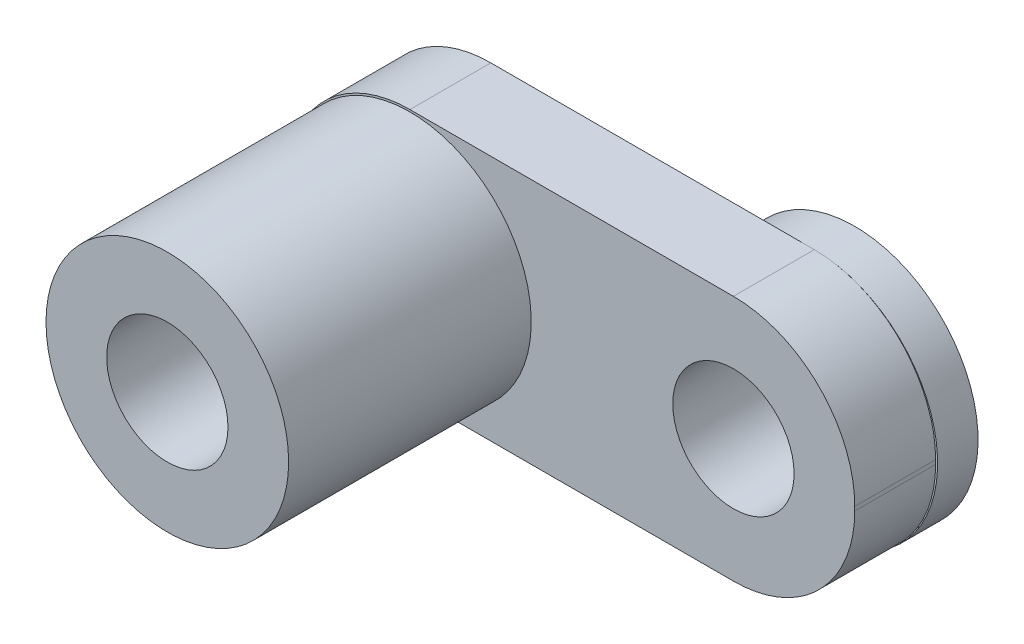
ISO-10303-21;
HEADER;
FILE_DESCRIPTION(('STEP AP214'),'2;1');
FILE_NAME('part.step','',(''),(''),'','','');
FILE_SCHEMA(('AUTOMOTIVE_DESIGN { 1 0 10303 214 1 1 1 1 }'));
ENDSEC;
DATA;
#1=APPLICATION_CONTEXT('core data for automotive mechanical design processes');
#2=APPLICATION_PROTOCOL_DEFINITION('international standard','automotive_design',2000,#1);
#3=PRODUCT_CONTEXT('',#1,'mechanical');
#4=PRODUCT('Part','Part','',(#3));
#5=PRODUCT_RELATED_PRODUCT_CATEGORY('part','',(#4));
#6=PRODUCT_DEFINITION_FORMATION('','',#4);
#7=PRODUCT_DEFINITION_CONTEXT('part definition',#1,'design');
#8=PRODUCT_DEFINITION('design','',#6,#7);
#9=PRODUCT_DEFINITION_SHAPE('','',#8);
#10=(LENGTH_UNIT() NAMED_UNIT(*) SI_UNIT(.MILLI.,.METRE.));
#11=(NAMED_UNIT(*) PLANE_ANGLE_UNIT() SI_UNIT($,.RADIAN.));
#12=(NAMED_UNIT(*) SI_UNIT($,.STERADIAN.) SOLID_ANGLE_UNIT());
#13=UNCERTAINTY_MEASURE_WITH_UNIT(LENGTH_MEASURE(1.E-05),#10,'distance_accuracy_value','');
#14=(GEOMETRIC_REPRESENTATION_CONTEXT(3) GLOBAL_UNCERTAINTY_ASSIGNED_CONTEXT((#13)) GLOBAL_UNIT_ASSIGNED_CONTEXT((#10,
#11,#12)) REPRESENTATION_CONTEXT('',''));
#15=CARTESIAN_POINT('',(0.,0.,0.));
#16=DIRECTION('',(0.,0.,1.));
#17=DIRECTION('',(1.,0.,0.));
#18=AXIS2_PLACEMENT_3D('',#15,#16,#17);
#19=CARTESIAN_POINT('',(3.,3.1,0.));
#20=DIRECTION('',(0.,0.,-1.));
#21=DIRECTION('',(-1.,0.,0.));
#22=AXIS2_PLACEMENT_3D('',#19,#20,#21);
#23=PLANE('',#22);
#24=CARTESIAN_POINT('',(3.,3.05,0.));
#25=DIRECTION('',(0.,0.,-1.));
#26=DIRECTION('',(-1.,0.,0.));
#27=AXIS2_PLACEMENT_3D('',#24,#25,#26);
#28=CIRCLE('',#27,1.5);
#29=CARTESIAN_POINT('',(1.5,3.05,0.));
#30=VERTEX_POINT('',#29);
#31=EDGE_CURVE('E113',#30,#30,#28,.T.);
#32=ORIENTED_EDGE('',*,*,#31,.F.);
#33=EDGE_LOOP('',(#32));
#34=FACE_BOUND('',#33,.T.);
#35=DIRECTION('',(-1.,0.,0.));
#36=VECTOR('',#35,1.);
#37=CARTESIAN_POINT('',(3.00000000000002,6.1,0.));
#38=LINE('',#37,#36);
#39=CARTESIAN_POINT('',(11.,6.1,0.));
#40=VERTEX_POINT('',#39);
#41=CARTESIAN_POINT('',(3.00000000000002,6.1,0.));
#42=VERTEX_POINT('',#41);
#43=EDGE_CURVE('E122',#40,#42,#38,.T.);
#44=ORIENTED_EDGE('',*,*,#43,.F.);
#45=CARTESIAN_POINT('',(11.,3.05,0.));
#46=DIRECTION('',(0.,0.,-1.));
#47=DIRECTION('',(-1.,0.,0.));
#48=AXIS2_PLACEMENT_3D('',#45,#46,#47);
#49=CIRCLE('',#48,3.05);
#50=CARTESIAN_POINT('',(11.,0.,0.));
#51=VERTEX_POINT('',#50);
#52=EDGE_CURVE('E11',#40,#51,#49,.F.);
#53=ORIENTED_EDGE('',*,*,#52,.T.);
#54=DIRECTION('',(1.,0.,0.));
#55=VECTOR('',#54,1.);
#56=CARTESIAN_POINT('',(3.00000000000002,0.,0.));
#57=LINE('',#56,#55);
#58=CARTESIAN_POINT('',(3.00000000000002,0.,0.));
#59=VERTEX_POINT('',#58);
#60=EDGE_CURVE('E183',#59,#51,#57,.T.);
#61=ORIENTED_EDGE('',*,*,#60,.F.);
#62=CARTESIAN_POINT('',(3.,3.,0.));
#63=DIRECTION('',(0.,0.,1.));
#64=DIRECTION('',(-1.,0.,0.));
#65=AXIS2_PLACEMENT_3D('',#62,#63,#64);
#66=CIRCLE('',#65,3.);
#67=CARTESIAN_POINT('',(0.,3.00000000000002,0.));
#68=VERTEX_POINT('',#67);
#69=EDGE_CURVE('E175',#68,#59,#66,.T.);
#70=ORIENTED_EDGE('',*,*,#69,.F.);
#71=DIRECTION('',(0.,-1.,0.));
#72=VECTOR('',#71,1.);
#73=CARTESIAN_POINT('',(0.,3.00000000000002,0.));
#74=LINE('',#73,#72);
#75=CARTESIAN_POINT('',(0.,3.09999999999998,0.));
#76=VERTEX_POINT('',#75);
#77=EDGE_CURVE('E169',#76,#68,#74,.T.);
#78=ORIENTED_EDGE('',*,*,#77,.F.);
#79=CARTESIAN_POINT('',(3.,3.1,0.));
#80=DIRECTION('',(0.,0.,1.));
#81=DIRECTION('',(-1.,0.,0.));
#82=AXIS2_PLACEMENT_3D('',#79,#80,#81);
#83=CIRCLE('',#82,3.);
#84=EDGE_CURVE('E132',#42,#76,#83,.T.);
#85=ORIENTED_EDGE('',*,*,#84,.F.);
#86=EDGE_LOOP('',(#44,#53,#61,#70,#78,#85));
#87=FACE_BOUND('',#86,.T.);
#88=ADVANCED_FACE('F31',(#34,#87),#23,.T.);
#89=CARTESIAN_POINT('',(3.,3.1,2.));
#90=DIRECTION('',(0.,0.,-1.));
#91=DIRECTION('',(-1.,0.,0.));
#92=AXIS2_PLACEMENT_3D('',#89,#90,#91);
#93=PLANE('',#92);
#94=CARTESIAN_POINT('',(11.,3.05,2.));
#95=DIRECTION('',(0.,0.,-1.));
#96=DIRECTION('',(-1.,0.,0.));
#97=AXIS2_PLACEMENT_3D('',#94,#95,#96);
#98=CIRCLE('',#97,1.5);
#99=CARTESIAN_POINT('',(9.5,3.05,2.));
#100=VERTEX_POINT('',#99);
#101=EDGE_CURVE('E213',#100,#100,#98,.T.);
#102=ORIENTED_EDGE('',*,*,#101,.T.);
#103=EDGE_LOOP('',(#102));
#104=FACE_BOUND('',#103,.T.);
#105=DIRECTION('',(0.,-1.,0.));
#106=VECTOR('',#105,1.);
#107=CARTESIAN_POINT('',(0.,3.00000000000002,2.));
#108=LINE('',#107,#106);
#109=CARTESIAN_POINT('',(0.,3.09999999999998,2.));
#110=VERTEX_POINT('',#109);
#111=CARTESIAN_POINT('',(0.,3.05,2.));
#112=VERTEX_POINT('',#111);
#113=EDGE_CURVE('E139',#110,#112,#108,.T.);
#114=ORIENTED_EDGE('',*,*,#113,.T.);
#115=CARTESIAN_POINT('',(3.,3.05,2.));
#116=DIRECTION('',(0.,0.,1.));
#117=DIRECTION('',(1.,0.,0.));
#118=AXIS2_PLACEMENT_3D('',#115,#116,#117);
#119=CIRCLE('',#118,3.);
#120=EDGE_CURVE('E178',#112,#112,#119,.T.);
#121=ORIENTED_EDGE('',*,*,#120,.F.);
#122=CARTESIAN_POINT('',(0.,3.00000000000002,2.));
#123=VERTEX_POINT('',#122);
#124=EDGE_CURVE('E135',#112,#123,#108,.T.);
#125=ORIENTED_EDGE('',*,*,#124,.T.);
#126=CARTESIAN_POINT('',(3.,3.,2.));
#127=DIRECTION('',(0.,0.,1.));
#128=DIRECTION('',(-1.,0.,0.));
#129=AXIS2_PLACEMENT_3D('',#126,#127,#128);
#130=CIRCLE('',#129,3.);
#131=CARTESIAN_POINT('',(3.00000000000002,0.,2.));
#132=VERTEX_POINT('',#131);
#133=EDGE_CURVE('E141',#123,#132,#130,.T.);
#134=ORIENTED_EDGE('',*,*,#133,.T.);
#135=DIRECTION('',(1.,0.,0.));
#136=VECTOR('',#135,1.);
#137=CARTESIAN_POINT('',(3.00000000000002,0.,2.));
#138=LINE('',#137,#136);
#139=CARTESIAN_POINT('',(11.,0.,2.));
#140=VERTEX_POINT('',#139);
#141=EDGE_CURVE('E143',#132,#140,#138,.T.);
#142=ORIENTED_EDGE('',*,*,#141,.T.);
#143=CARTESIAN_POINT('',(11.,3.,2.));
#144=DIRECTION('',(0.,0.,1.));
#145=DIRECTION('',(1.,0.,0.));
#146=AXIS2_PLACEMENT_3D('',#143,#144,#145);
#147=CIRCLE('',#146,3.);
#148=CARTESIAN_POINT('',(14.,3.00000000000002,2.));
#149=VERTEX_POINT('',#148);
#150=EDGE_CURVE('E145',#140,#149,#147,.T.);
#151=ORIENTED_EDGE('',*,*,#150,.T.);
#152=DIRECTION('',(0.,1.,0.));
#153=VECTOR('',#152,1.);
#154=CARTESIAN_POINT('',(14.,3.00000000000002,2.));
#155=LINE('',#154,#153);
#156=CARTESIAN_POINT('',(14.,3.09999999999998,2.));
#157=VERTEX_POINT('',#156);
#158=EDGE_CURVE('E147',#149,#157,#155,.T.);
#159=ORIENTED_EDGE('',*,*,#158,.T.);
#160=CARTESIAN_POINT('',(11.,3.1,2.));
#161=DIRECTION('',(0.,0.,1.));
#162=DIRECTION('',(-1.,0.,0.));
#163=AXIS2_PLACEMENT_3D('',#160,#161,#162);
#164=CIRCLE('',#163,3.);
#165=CARTESIAN_POINT('',(11.,6.1,2.));
#166=VERTEX_POINT('',#165);
#167=EDGE_CURVE('E51',#157,#166,#164,.T.);
#168=ORIENTED_EDGE('',*,*,#167,.T.);
#169=DIRECTION('',(-1.,0.,0.));
#170=VECTOR('',#169,1.);
#171=CARTESIAN_POINT('',(3.00000000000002,6.1,2.));
#172=LINE('',#171,#170);
#173=CARTESIAN_POINT('',(3.00000000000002,6.1,2.));
#174=VERTEX_POINT('',#173);
#175=EDGE_CURVE('E46',#166,#174,#172,.T.);
#176=ORIENTED_EDGE('',*,*,#175,.T.);
#177=CARTESIAN_POINT('',(3.,3.1,2.));
#178=DIRECTION('',(0.,0.,1.));
#179=DIRECTION('',(-1.,0.,0.));
#180=AXIS2_PLACEMENT_3D('',#177,#178,#179);
#181=CIRCLE('',#180,3.);
#182=EDGE_CURVE('E133',#174,#110,#181,.T.);
#183=ORIENTED_EDGE('',*,*,#182,.T.);
#184=EDGE_LOOP('',(#114,#121,#125,#134,#142,#151,#159,#168,#176,#183));
#185=FACE_BOUND('',#184,.T.);
#186=ADVANCED_FACE('F203',(#104,#185),#93,.F.);
#187=CARTESIAN_POINT('',(3.,3.1,2.));
#188=DIRECTION('',(0.,0.,-1.));
#189=DIRECTION('',(-1.,0.,0.));
#190=AXIS2_PLACEMENT_3D('',#187,#188,#189);
#191=CYLINDRICAL_SURFACE('',#190,3.);
#192=ORIENTED_EDGE('',*,*,#84,.T.);
#193=DIRECTION('',(0.,0.,-1.));
#194=VECTOR('',#193,1.);
#195=CARTESIAN_POINT('',(0.,3.09999999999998,2.));
#196=LINE('',#195,#194);
#197=EDGE_CURVE('E39',#110,#76,#196,.T.);
#198=ORIENTED_EDGE('',*,*,#197,.F.);
#199=ORIENTED_EDGE('',*,*,#182,.F.);
#200=DIRECTION('',(0.,0.,-1.));
#201=VECTOR('',#200,1.);
#202=CARTESIAN_POINT('',(3.00000000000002,6.1,2.));
#203=LINE('',#202,#201);
#204=EDGE_CURVE('E128',#174,#42,#203,.T.);
#205=ORIENTED_EDGE('',*,*,#204,.T.);
#206=EDGE_LOOP('',(#192,#198,#199,#205));
#207=FACE_BOUND('',#206,.T.);
#208=ADVANCED_FACE('F33',(#207),#191,.T.);
#209=CARTESIAN_POINT('',(0.,3.00000000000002,2.));
#210=DIRECTION('',(1.,0.,0.));
#211=DIRECTION('',(0.,0.,-1.));
#212=AXIS2_PLACEMENT_3D('',#209,#210,#211);
#213=PLANE('',#212);
#214=ORIENTED_EDGE('',*,*,#77,.T.);
#215=DIRECTION('',(0.,0.,-1.));
#216=VECTOR('',#215,1.);
#217=CARTESIAN_POINT('',(0.,3.00000000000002,2.));
#218=LINE('',#217,#216);
#219=EDGE_CURVE('E162',#123,#68,#218,.T.);
#220=ORIENTED_EDGE('',*,*,#219,.F.);
#221=ORIENTED_EDGE('',*,*,#124,.F.);
#222=ORIENTED_EDGE('',*,*,#113,.F.);
#223=ORIENTED_EDGE('',*,*,#197,.T.);
#224=EDGE_LOOP('',(#214,#220,#221,#222,#223));
#225=FACE_BOUND('',#224,.T.);
#226=ADVANCED_FACE('F167',(#225),#213,.F.);
#227=CARTESIAN_POINT('',(3.,3.,2.));
#228=DIRECTION('',(0.,0.,-1.));
#229=DIRECTION('',(-1.,0.,0.));
#230=AXIS2_PLACEMENT_3D('',#227,#228,#229);
#231=CYLINDRICAL_SURFACE('',#230,3.);
#232=ORIENTED_EDGE('',*,*,#69,.T.);
#233=DIRECTION('',(0.,0.,-1.));
#234=VECTOR('',#233,1.);
#235=CARTESIAN_POINT('',(3.00000000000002,0.,2.));
#236=LINE('',#235,#234);
#237=EDGE_CURVE('E159',#132,#59,#236,.T.);
#238=ORIENTED_EDGE('',*,*,#237,.F.);
#239=ORIENTED_EDGE('',*,*,#133,.F.);
#240=ORIENTED_EDGE('',*,*,#219,.T.);
#241=EDGE_LOOP('',(#232,#238,#239,#240));
#242=FACE_BOUND('',#241,.T.);
#243=ADVANCED_FACE('F199',(#242),#231,.T.);
#244=CARTESIAN_POINT('',(3.00000000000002,0.,2.));
#245=DIRECTION('',(0.,1.,0.));
#246=DIRECTION('',(0.,0.,1.));
#247=AXIS2_PLACEMENT_3D('',#244,#245,#246);
#248=PLANE('',#247);
#249=ORIENTED_EDGE('',*,*,#60,.T.);
#250=DIRECTION('',(0.,0.,-1.));
#251=VECTOR('',#250,1.);
#252=CARTESIAN_POINT('',(11.,0.,2.));
#253=LINE('',#252,#251);
#254=EDGE_CURVE('E156',#140,#51,#253,.T.);
#255=ORIENTED_EDGE('',*,*,#254,.F.);
#256=ORIENTED_EDGE('',*,*,#141,.F.);
#257=ORIENTED_EDGE('',*,*,#237,.T.);
#258=EDGE_LOOP('',(#249,#255,#256,#257));
#259=FACE_BOUND('',#258,.T.);
#260=ADVANCED_FACE('F195',(#259),#248,.F.);
#261=CARTESIAN_POINT('',(11.,3.,2.));
#262=DIRECTION('',(0.,0.,-1.));
#263=DIRECTION('',(-1.,0.,0.));
#264=AXIS2_PLACEMENT_3D('',#261,#262,#263);
#265=CYLINDRICAL_SURFACE('',#264,3.);
#266=CARTESIAN_POINT('',(11.,3.,0.));
#267=DIRECTION('',(0.,0.,1.));
#268=DIRECTION('',(1.,0.,0.));
#269=AXIS2_PLACEMENT_3D('',#266,#267,#268);
#270=CIRCLE('',#269,3.);
#271=CARTESIAN_POINT('',(14.,3.00000000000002,0.));
#272=VERTEX_POINT('',#271);
#273=EDGE_CURVE('E111',#51,#272,#270,.T.);
#274=ORIENTED_EDGE('',*,*,#273,.T.);
#275=DIRECTION('',(0.,0.,-1.));
#276=VECTOR('',#275,1.);
#277=CARTESIAN_POINT('',(14.,3.00000000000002,2.));
#278=LINE('',#277,#276);
#279=EDGE_CURVE('E153',#149,#272,#278,.T.);
#280=ORIENTED_EDGE('',*,*,#279,.F.);
#281=ORIENTED_EDGE('',*,*,#150,.F.);
#282=ORIENTED_EDGE('',*,*,#254,.T.);
#283=EDGE_LOOP('',(#274,#280,#281,#282));
#284=FACE_BOUND('',#283,.T.);
#285=ADVANCED_FACE('F190',(#284),#265,.T.);
#286=CARTESIAN_POINT('',(14.,3.00000000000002,2.));
#287=DIRECTION('',(-1.,0.,0.));
#288=DIRECTION('',(0.,0.,1.));
#289=AXIS2_PLACEMENT_3D('',#286,#287,#288);
#290=PLANE('',#289);
#291=DIRECTION('',(0.,1.,0.));
#292=VECTOR('',#291,1.);
#293=CARTESIAN_POINT('',(14.,3.00000000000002,0.));
#294=LINE('',#293,#292);
#295=CARTESIAN_POINT('',(14.,3.09999999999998,0.));
#296=VERTEX_POINT('',#295);
#297=EDGE_CURVE('E123',#272,#296,#294,.T.);
#298=ORIENTED_EDGE('',*,*,#297,.T.);
#299=DIRECTION('',(0.,0.,-1.));
#300=VECTOR('',#299,1.);
#301=CARTESIAN_POINT('',(14.,3.09999999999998,2.));
#302=LINE('',#301,#300);
#303=EDGE_CURVE('E121',#157,#296,#302,.T.);
#304=ORIENTED_EDGE('',*,*,#303,.F.);
#305=ORIENTED_EDGE('',*,*,#158,.F.);
#306=ORIENTED_EDGE('',*,*,#279,.T.);
#307=EDGE_LOOP('',(#298,#304,#305,#306));
#308=FACE_BOUND('',#307,.T.);
#309=ADVANCED_FACE('F186',(#308),#290,.F.);
#310=CARTESIAN_POINT('',(11.,3.1,2.));
#311=DIRECTION('',(0.,0.,-1.));
#312=DIRECTION('',(-1.,0.,0.));
#313=AXIS2_PLACEMENT_3D('',#310,#311,#312);
#314=CYLINDRICAL_SURFACE('',#313,3.);
#315=CARTESIAN_POINT('',(11.,3.1,0.));
#316=DIRECTION('',(0.,0.,1.));
#317=DIRECTION('',(-1.,0.,0.));
#318=AXIS2_PLACEMENT_3D('',#315,#316,#317);
#319=CIRCLE('',#318,3.);
#320=EDGE_CURVE('E108',#296,#40,#319,.T.);
#321=ORIENTED_EDGE('',*,*,#320,.T.);
#322=DIRECTION('',(0.,0.,-1.));
#323=VECTOR('',#322,1.);
#324=CARTESIAN_POINT('',(11.,6.1,2.));
#325=LINE('',#324,#323);
#326=EDGE_CURVE('E119',#166,#40,#325,.T.);
#327=ORIENTED_EDGE('',*,*,#326,.F.);
#328=ORIENTED_EDGE('',*,*,#167,.F.);
#329=ORIENTED_EDGE('',*,*,#303,.T.);
#330=EDGE_LOOP('',(#321,#327,#328,#329));
#331=FACE_BOUND('',#330,.T.);
#332=ADVANCED_FACE('F118',(#331),#314,.T.);
#333=CARTESIAN_POINT('',(3.00000000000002,6.1,2.));
#334=DIRECTION('',(0.,-1.,0.));
#335=DIRECTION('',(0.,0.,-1.));
#336=AXIS2_PLACEMENT_3D('',#333,#334,#335);
#337=PLANE('',#336);
#338=ORIENTED_EDGE('',*,*,#43,.T.);
#339=ORIENTED_EDGE('',*,*,#204,.F.);
#340=ORIENTED_EDGE('',*,*,#175,.F.);
#341=ORIENTED_EDGE('',*,*,#326,.T.);
#342=EDGE_LOOP('',(#338,#339,#340,#341));
#343=FACE_BOUND('',#342,.T.);
#344=ADVANCED_FACE('F126',(#343),#337,.F.);
#345=CARTESIAN_POINT('',(3.,3.05,8.));
#346=DIRECTION('',(0.,0.,-1.));
#347=DIRECTION('',(-1.,0.,0.));
#348=AXIS2_PLACEMENT_3D('',#345,#346,#347);
#349=CYLINDRICAL_SURFACE('',#348,3.);
#350=CARTESIAN_POINT('',(3.,3.05,8.));
#351=DIRECTION('',(0.,0.,1.));
#352=DIRECTION('',(1.,0.,0.));
#353=AXIS2_PLACEMENT_3D('',#350,#351,#352);
#354=CIRCLE('',#353,3.);
#355=CARTESIAN_POINT('',(6.,3.05,8.));
#356=VERTEX_POINT('',#355);
#357=EDGE_CURVE('E173',#356,#356,#354,.T.);
#358=ORIENTED_EDGE('',*,*,#357,.F.);
#359=EDGE_LOOP('',(#358));
#360=FACE_BOUND('',#359,.T.);
#361=ORIENTED_EDGE('',*,*,#120,.T.);
#362=EDGE_LOOP('',(#361));
#363=FACE_BOUND('',#362,.T.);
#364=ADVANCED_FACE('F243',(#360,#363),#349,.T.);
#365=CARTESIAN_POINT('',(3.,3.05,8.));
#366=DIRECTION('',(0.,0.,1.));
#367=DIRECTION('',(1.,0.,0.));
#368=AXIS2_PLACEMENT_3D('',#365,#366,#367);
#369=PLANE('',#368);
#370=CARTESIAN_POINT('',(3.,3.05,8.));
#371=DIRECTION('',(0.,0.,1.));
#372=DIRECTION('',(1.,0.,0.));
#373=AXIS2_PLACEMENT_3D('',#370,#371,#372);
#374=CIRCLE('',#373,1.5);
#375=CARTESIAN_POINT('',(4.5,3.05,8.));
#376=VERTEX_POINT('',#375);
#377=EDGE_CURVE('E210',#376,#376,#374,.T.);
#378=ORIENTED_EDGE('',*,*,#377,.F.);
#379=EDGE_LOOP('',(#378));
#380=FACE_BOUND('',#379,.T.);
#381=ORIENTED_EDGE('',*,*,#357,.T.);
#382=EDGE_LOOP('',(#381));
#383=FACE_BOUND('',#382,.T.);
#384=ADVANCED_FACE('F264',(#380,#383),#369,.T.);
#385=CARTESIAN_POINT('',(11.,3.05,0.));
#386=DIRECTION('',(0.,0.,-1.));
#387=DIRECTION('',(-1.,0.,0.));
#388=AXIS2_PLACEMENT_3D('',#385,#386,#387);
#389=PLANE('',#388);
#390=ORIENTED_EDGE('',*,*,#297,.F.);
#391=ORIENTED_EDGE('',*,*,#273,.F.);
#392=CARTESIAN_POINT('',(11.,3.05,0.));
#393=DIRECTION('',(0.,0.,-1.));
#394=DIRECTION('',(-1.,0.,0.));
#395=AXIS2_PLACEMENT_3D('',#392,#393,#394);
#396=CIRCLE('',#395,3.05);
#397=EDGE_CURVE('E99',#40,#51,#396,.T.);
#398=ORIENTED_EDGE('',*,*,#397,.F.);
#399=ORIENTED_EDGE('',*,*,#320,.F.);
#400=EDGE_LOOP('',(#390,#391,#398,#399));
#401=FACE_BOUND('',#400,.T.);
#402=ADVANCED_FACE('F107',(#401),#389,.F.);
#403=CARTESIAN_POINT('',(11.,3.05,-1.));
#404=DIRECTION('',(0.,0.,1.));
#405=DIRECTION('',(1.,0.,0.));
#406=AXIS2_PLACEMENT_3D('',#403,#404,#405);
#407=CYLINDRICAL_SURFACE('',#406,3.05);
#408=CARTESIAN_POINT('',(11.,3.05,-1.));
#409=DIRECTION('',(0.,0.,-1.));
#410=DIRECTION('',(-1.,0.,0.));
#411=AXIS2_PLACEMENT_3D('',#408,#409,#410);
#412=CIRCLE('',#411,3.05);
#413=CARTESIAN_POINT('',(7.95,3.05,-1.));
#414=VERTEX_POINT('',#413);
#415=EDGE_CURVE('E112',#414,#414,#412,.T.);
#416=ORIENTED_EDGE('',*,*,#415,.F.);
#417=EDGE_LOOP('',(#416));
#418=FACE_BOUND('',#417,.T.);
#419=ORIENTED_EDGE('',*,*,#397,.T.);
#420=ORIENTED_EDGE('',*,*,#52,.F.);
#421=EDGE_LOOP('',(#419,#420));
#422=FACE_BOUND('',#421,.T.);
#423=ADVANCED_FACE('F98',(#418,#422),#407,.T.);
#424=CARTESIAN_POINT('',(11.,3.05,-1.));
#425=DIRECTION('',(0.,0.,-1.));
#426=DIRECTION('',(-1.,0.,0.));
#427=AXIS2_PLACEMENT_3D('',#424,#425,#426);
#428=PLANE('',#427);
#429=CARTESIAN_POINT('',(11.,3.05,-1.));
#430=DIRECTION('',(0.,0.,1.));
#431=DIRECTION('',(1.,0.,0.));
#432=AXIS2_PLACEMENT_3D('',#429,#430,#431);
#433=CIRCLE('',#432,1.5);
#434=CARTESIAN_POINT('',(12.5,3.05,-1.));
#435=VERTEX_POINT('',#434);
#436=EDGE_CURVE('E216',#435,#435,#433,.T.);
#437=ORIENTED_EDGE('',*,*,#436,.T.);
#438=EDGE_LOOP('',(#437));
#439=FACE_BOUND('',#438,.T.);
#440=ORIENTED_EDGE('',*,*,#415,.T.);
#441=EDGE_LOOP('',(#440));
#442=FACE_BOUND('',#441,.T.);
#443=ADVANCED_FACE('F220',(#439,#442),#428,.T.);
#444=CARTESIAN_POINT('',(3.,3.05,-1.));
#445=DIRECTION('',(0.,0.,1.));
#446=DIRECTION('',(1.,0.,0.));
#447=AXIS2_PLACEMENT_3D('',#444,#445,#446);
#448=CYLINDRICAL_SURFACE('',#447,1.5);
#449=ORIENTED_EDGE('',*,*,#31,.T.);
#450=EDGE_LOOP('',(#449));
#451=FACE_BOUND('',#450,.T.);
#452=ORIENTED_EDGE('',*,*,#377,.T.);
#453=EDGE_LOOP('',(#452));
#454=FACE_BOUND('',#453,.T.);
#455=ADVANCED_FACE('F226',(#451,#454),#448,.F.);
#456=CARTESIAN_POINT('',(11.,3.05,-1.));
#457=DIRECTION('',(0.,0.,1.));
#458=DIRECTION('',(1.,0.,0.));
#459=AXIS2_PLACEMENT_3D('',#456,#457,#458);
#460=CYLINDRICAL_SURFACE('',#459,1.5);
#461=ORIENTED_EDGE('',*,*,#436,.F.);
#462=EDGE_LOOP('',(#461));
#463=FACE_BOUND('',#462,.T.);
#464=ORIENTED_EDGE('',*,*,#101,.F.);
#465=EDGE_LOOP('',(#464));
#466=FACE_BOUND('',#465,.T.);
#467=ADVANCED_FACE('F223',(#463,#466),#460,.F.);
#468=CLOSED_SHELL('',(#88,#186,#208,#226,#243,#260,#285,#309,#332,#344,#364,#384,#402,#423,#443,
#455,#467));
#469=MANIFOLD_SOLID_BREP('B2',#468);
#470=ADVANCED_BREP_SHAPE_REPRESENTATION('',(#18,#469),#14);
#471=SHAPE_DEFINITION_REPRESENTATION(#9,#470);
ENDSEC;
END-ISO-10303-21;
